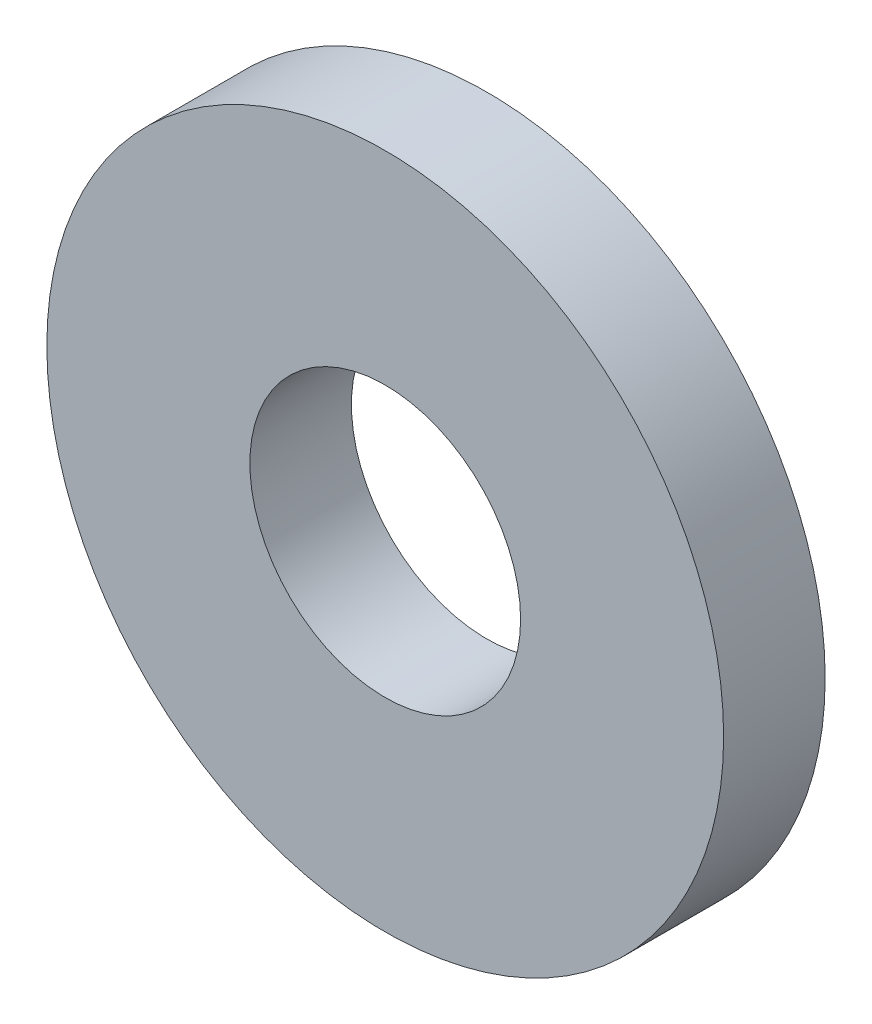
from build123d import *

# Parameters (mm, degrees)
ESQUISSE1_R        = 10
ESQUISSE1_R_2      = 4
BOSS_EXTRU_1_DEPTH = 3


with BuildPart() as part:
    # Esquisse1 → Boss.-Extru.1 (new body)
    with BuildSketch(Plane.XY):
        Circle(ESQUISSE1_R)
        Circle(ESQUISSE1_R_2, mode=Mode.SUBTRACT)
    extrude(amount=BOSS_EXTRU_1_DEPTH)


solid = part.part
